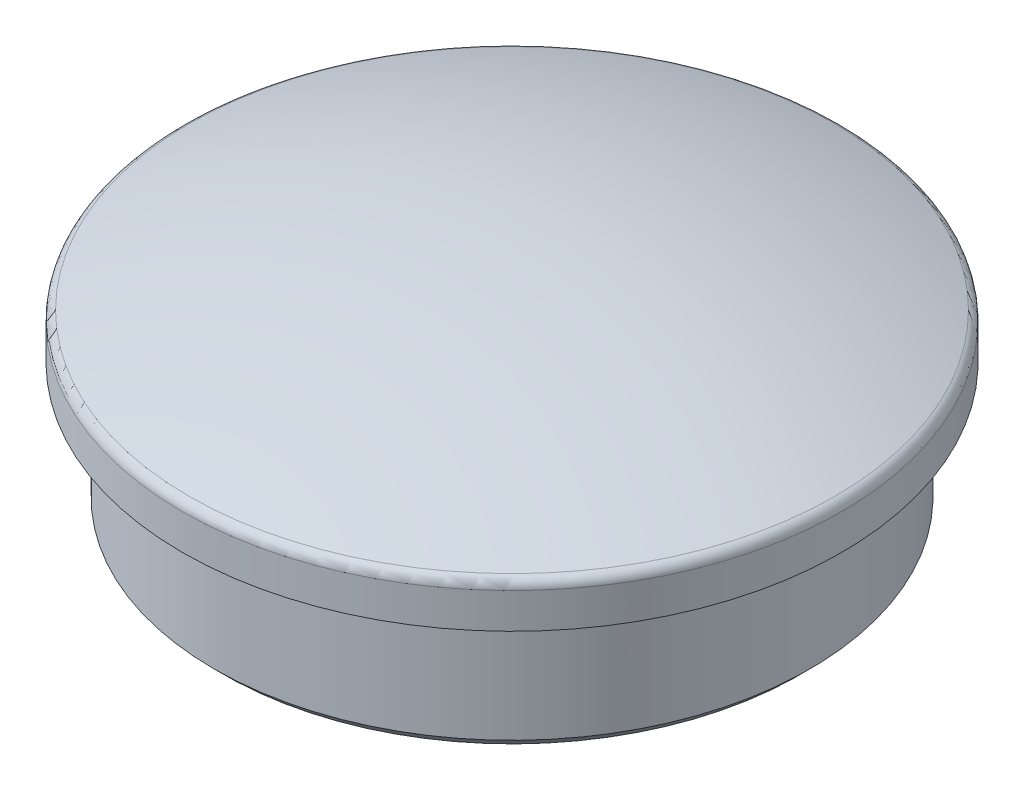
from build123d import *

# Parameters (mm, degrees)
ENL_V_MAT_EXTRU_1_DEPTH = 9
CHANFREIN1_SIZE         = 0.5
CONG_1_R                = 0.5


with BuildPart() as part:
    # Esquisse1 → R_volution1 (revolve)
    with BuildSketch(Plane.XY, mode=Mode.PRIVATE) as r_volution1_sk:
        with BuildLine():
            Line((0, 0), (-14, 0))
            Line((-14, 0), (-14, 6))
            Line((-14, 6), (-15.5, 6))
            Line((-15.5, 6), (-15.5, 8))
            ThreePointArc((-15.5, 8), (-7.893826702, 10.243104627), (0, 11))
            Line((0, 11), (0, 0))
        make_face()
    revolve(r_volution1_sk.sketch.rotate(Axis((0, 20.667412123, 0), (0, -1, 0)), 270), axis=Axis((0, 20.667412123, 0), (0, -1, 0)))

    # Esquisse2 → Enl_v. mat.-Extru.1 (cut)
    with BuildSketch(Plane.XZ):
        Polygon((10.392304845, 0), (5.196152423, 9), (-5.196152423, 9), (-10.392304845, 0), (-5.196152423, -9), (5.196152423, -9), align=None)
    extrude(amount=-ENL_V_MAT_EXTRU_1_DEPTH, mode=Mode.SUBTRACT)

    # Chanfrein1
    chanfrein1_edges = [part.edges().sort_by_distance(p)[0] for p in [
        (0, 0, -14),
    ]]
    chamfer(chanfrein1_edges, length=CHANFREIN1_SIZE)

    # Cong_1
    cong_1_edges = [part.edges().sort_by_distance(p)[0] for p in [
        (0, 8, -15.5),
    ]]
    fillet(cong_1_edges, radius=CONG_1_R)


solid = part.part
